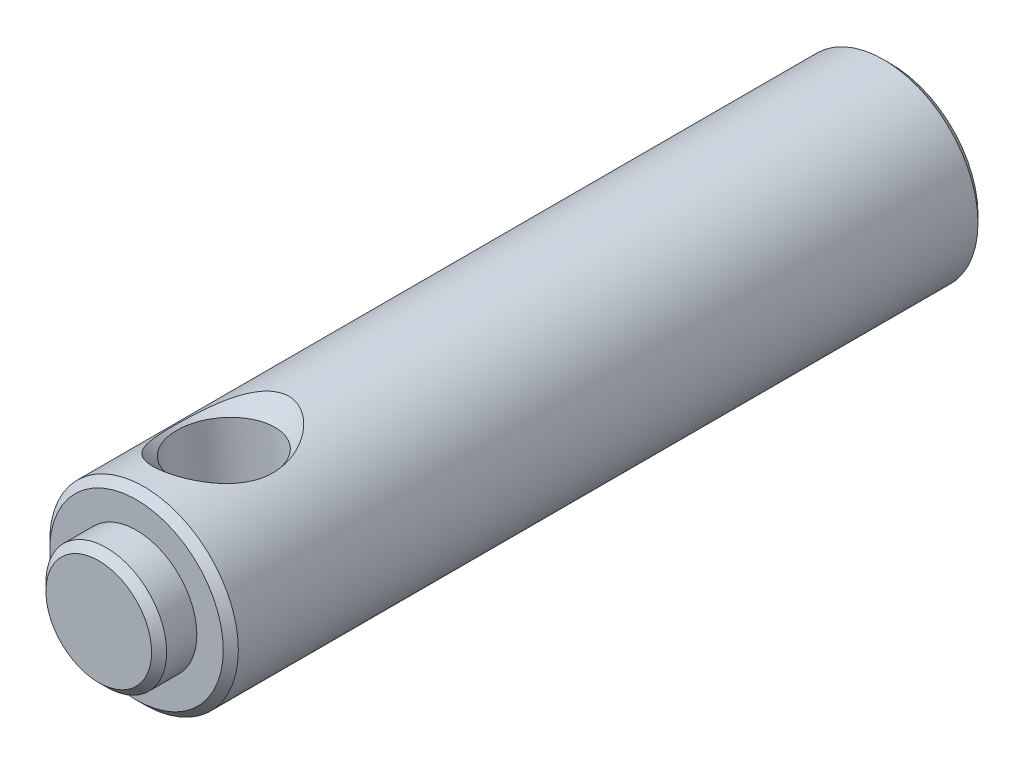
ISO-10303-21;
HEADER;
FILE_DESCRIPTION(('STEP AP214'),'2;1');
FILE_NAME('part.step','',(''),(''),'','','');
FILE_SCHEMA(('AUTOMOTIVE_DESIGN { 1 0 10303 214 1 1 1 1 }'));
ENDSEC;
DATA;
#1=APPLICATION_CONTEXT('core data for automotive mechanical design processes');
#2=APPLICATION_PROTOCOL_DEFINITION('international standard','automotive_design',2000,#1);
#3=PRODUCT_CONTEXT('',#1,'mechanical');
#4=PRODUCT('Part','Part','',(#3));
#5=PRODUCT_RELATED_PRODUCT_CATEGORY('part','',(#4));
#6=PRODUCT_DEFINITION_FORMATION('','',#4);
#7=PRODUCT_DEFINITION_CONTEXT('part definition',#1,'design');
#8=PRODUCT_DEFINITION('design','',#6,#7);
#9=PRODUCT_DEFINITION_SHAPE('','',#8);
#10=(LENGTH_UNIT() NAMED_UNIT(*) SI_UNIT(.MILLI.,.METRE.));
#11=(NAMED_UNIT(*) PLANE_ANGLE_UNIT() SI_UNIT($,.RADIAN.));
#12=(NAMED_UNIT(*) SI_UNIT($,.STERADIAN.) SOLID_ANGLE_UNIT());
#13=UNCERTAINTY_MEASURE_WITH_UNIT(LENGTH_MEASURE(1.E-05),#10,'distance_accuracy_value','');
#14=(GEOMETRIC_REPRESENTATION_CONTEXT(3) GLOBAL_UNCERTAINTY_ASSIGNED_CONTEXT((#13)) GLOBAL_UNIT_ASSIGNED_CONTEXT((#10,
#11,#12)) REPRESENTATION_CONTEXT('',''));
#15=CARTESIAN_POINT('',(0.,0.,0.));
#16=DIRECTION('',(0.,0.,1.));
#17=DIRECTION('',(1.,0.,0.));
#18=AXIS2_PLACEMENT_3D('',#15,#16,#17);
#19=CARTESIAN_POINT('',(0.,0.,20.));
#20=DIRECTION('',(0.,0.,-1.));
#21=DIRECTION('',(-1.,0.,0.));
#22=AXIS2_PLACEMENT_3D('',#19,#20,#21);
#23=CYLINDRICAL_SURFACE('',#22,2.5);
#24=CARTESIAN_POINT('',(0.,0.,19.8));
#25=DIRECTION('',(0.,0.,1.));
#26=DIRECTION('',(1.,0.,0.));
#27=AXIS2_PLACEMENT_3D('',#24,#25,#26);
#28=CIRCLE('',#27,2.5);
#29=CARTESIAN_POINT('',(2.5,0.,19.8));
#30=VERTEX_POINT('',#29);
#31=EDGE_CURVE('E41',#30,#30,#28,.F.);
#32=ORIENTED_EDGE('',*,*,#31,.T.);
#33=EDGE_LOOP('',(#32));
#34=FACE_BOUND('',#33,.T.);
#35=CARTESIAN_POINT('',(0.,0.,0.199999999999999));
#36=DIRECTION('',(0.,0.,1.));
#37=DIRECTION('',(1.,0.,0.));
#38=AXIS2_PLACEMENT_3D('',#35,#36,#37);
#39=CIRCLE('',#38,2.5);
#40=CARTESIAN_POINT('',(2.5,0.,0.199999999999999));
#41=VERTEX_POINT('',#40);
#42=EDGE_CURVE('E45',#41,#41,#39,.T.);
#43=ORIENTED_EDGE('',*,*,#42,.T.);
#44=EDGE_LOOP('',(#43));
#45=FACE_BOUND('',#44,.T.);
#46=CARTESIAN_POINT('',(-0.969141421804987,2.30451022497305,16.1102960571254));
#47=CARTESIAN_POINT('',(-0.913977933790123,2.32770949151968,16.0585810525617));
#48=CARTESIAN_POINT('',(-0.854295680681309,2.35048570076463,16.0114111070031));
#49=CARTESIAN_POINT('',(-0.72618172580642,2.39315123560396,15.9291838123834));
#50=CARTESIAN_POINT('',(-0.657773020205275,2.41304786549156,15.894095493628));
#51=CARTESIAN_POINT('',(-0.535920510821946,2.44242353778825,15.8477460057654));
#52=CARTESIAN_POINT('',(-0.484313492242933,2.4532266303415,15.8324783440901));
#53=CARTESIAN_POINT('',(-0.378792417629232,2.47171481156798,15.8103306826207));
#54=CARTESIAN_POINT('',(-0.324880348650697,2.47940252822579,15.8034436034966));
#55=CARTESIAN_POINT('',(-0.216146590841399,2.49124027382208,15.7985638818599));
#56=CARTESIAN_POINT('',(-0.161323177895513,2.49538256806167,15.8005906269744));
#57=CARTESIAN_POINT('',(-0.0525577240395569,2.50004083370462,15.8134215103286));
#58=CARTESIAN_POINT('',(0.00138400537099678,2.50055554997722,15.8242286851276));
#59=CARTESIAN_POINT('',(0.105768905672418,2.49829625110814,15.8535258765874));
#60=CARTESIAN_POINT('',(0.156262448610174,2.49559294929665,15.871845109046));
#61=CARTESIAN_POINT('',(0.254071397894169,2.48754121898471,15.915112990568));
#62=CARTESIAN_POINT('',(0.30138536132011,2.48219159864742,15.9400646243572));
#63=CARTESIAN_POINT('',(0.413355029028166,2.46650489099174,16.008392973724));
#64=CARTESIAN_POINT('',(0.475908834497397,2.45500541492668,16.054953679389));
#65=CARTESIAN_POINT('',(0.592509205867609,2.42950919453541,16.157195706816));
#66=CARTESIAN_POINT('',(0.646534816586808,2.41550647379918,16.2128988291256));
#67=CARTESIAN_POINT('',(0.760510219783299,2.38245704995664,16.3486052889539));
#68=CARTESIAN_POINT('',(0.817584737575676,2.36313127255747,16.4309552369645));
#69=CARTESIAN_POINT('',(0.917480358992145,2.32617028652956,16.604174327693));
#70=CARTESIAN_POINT('',(0.960294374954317,2.3085359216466,16.6950476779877));
#71=CARTESIAN_POINT('',(1.03190270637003,2.27743737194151,16.8839793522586));
#72=CARTESIAN_POINT('',(1.06054421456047,2.26401918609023,16.9821034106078));
#73=CARTESIAN_POINT('',(1.10264148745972,2.24382149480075,17.1821516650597));
#74=CARTESIAN_POINT('',(1.1161102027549,2.23703632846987,17.2840725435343));
#75=CARTESIAN_POINT('',(1.12766808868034,2.23123619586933,17.4914730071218));
#76=CARTESIAN_POINT('',(1.12538159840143,2.23241101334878,17.5969793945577));
#77=CARTESIAN_POINT('',(1.10460572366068,2.24276010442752,17.8060295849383));
#78=CARTESIAN_POINT('',(1.08610618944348,2.25193938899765,17.9095721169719));
#79=CARTESIAN_POINT('',(1.03383473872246,2.27639927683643,18.110005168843));
#80=CARTESIAN_POINT('',(1.0003303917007,2.29157245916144,18.20697935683));
#81=CARTESIAN_POINT('',(0.918503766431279,2.32557768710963,18.3938271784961));
#82=CARTESIAN_POINT('',(0.870180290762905,2.34441002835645,18.4837002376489));
#83=CARTESIAN_POINT('',(0.767906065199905,2.3796524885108,18.639718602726));
#84=CARTESIAN_POINT('',(0.716168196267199,2.3959550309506,18.7073406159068));
#85=CARTESIAN_POINT('',(0.602271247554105,2.4270852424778,18.8335566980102));
#86=CARTESIAN_POINT('',(0.540129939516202,2.44191535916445,18.8921658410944));
#87=CARTESIAN_POINT('',(0.422663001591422,2.46454272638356,18.9840163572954));
#88=CARTESIAN_POINT('',(0.369588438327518,2.47317007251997,19.01992464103));
#89=CARTESIAN_POINT('',(0.258221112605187,2.48725886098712,19.0833093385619));
#90=CARTESIAN_POINT('',(0.199935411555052,2.49272451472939,19.11079694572));
#91=CARTESIAN_POINT('',(0.0882270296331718,2.49897282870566,19.1522000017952));
#92=CARTESIAN_POINT('',(0.0353613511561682,2.50032886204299,19.1675220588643));
#93=CARTESIAN_POINT('',(-0.0720956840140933,2.49953619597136,19.1897262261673));
#94=CARTESIAN_POINT('',(-0.126685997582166,2.49738957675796,19.1966133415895));
#95=CARTESIAN_POINT('',(-0.236116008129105,2.48943052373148,19.2014367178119));
#96=CARTESIAN_POINT('',(-0.290955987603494,2.48361048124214,19.1993543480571));
#97=CARTESIAN_POINT('',(-0.399093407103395,2.46854378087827,19.1863614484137));
#98=CARTESIAN_POINT('',(-0.452390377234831,2.45929609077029,19.1754482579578));
#99=CARTESIAN_POINT('',(-0.554780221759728,2.43821437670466,19.1459436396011));
#100=CARTESIAN_POINT('',(-0.603943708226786,2.42644851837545,19.1275448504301));
#101=CARTESIAN_POINT('',(-0.698660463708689,2.40089261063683,19.0841257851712));
#102=CARTESIAN_POINT('',(-0.744212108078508,2.38710165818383,19.0591025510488));
#103=CARTESIAN_POINT('',(-0.851522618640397,2.35147237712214,18.9905668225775));
#104=CARTESIAN_POINT('',(-0.910993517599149,2.32886939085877,18.9438629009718));
#105=CARTESIAN_POINT('',(-1.02109645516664,2.28274945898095,18.8413324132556));
#106=CARTESIAN_POINT('',(-1.0717066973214,2.259230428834,18.7854839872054));
#107=CARTESIAN_POINT('',(-1.17778856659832,2.20619223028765,18.6494864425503));
#108=CARTESIAN_POINT('',(-1.23038336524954,2.17692043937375,18.566997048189));
#109=CARTESIAN_POINT('',(-1.32184060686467,2.12263218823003,18.3935085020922));
#110=CARTESIAN_POINT('',(-1.36069626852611,2.09761783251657,18.3025051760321));
#111=CARTESIAN_POINT('',(-1.42534373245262,2.05424697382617,18.1133326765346));
#112=CARTESIAN_POINT('',(-1.45099456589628,2.03596288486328,18.0150984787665));
#113=CARTESIAN_POINT('',(-1.48853181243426,2.0086860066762,17.8148553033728));
#114=CARTESIAN_POINT('',(-1.5004306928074,1.9996848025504,17.7128498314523));
#115=CARTESIAN_POINT('',(-1.5104717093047,1.99211517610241,17.5054082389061));
#116=CARTESIAN_POINT('',(-1.50829187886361,1.99379091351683,17.3999471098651));
#117=CARTESIAN_POINT('',(-1.48944085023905,2.00790853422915,17.1909833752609));
#118=CARTESIAN_POINT('',(-1.47275626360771,2.02036036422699,17.0874826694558));
#119=CARTESIAN_POINT('',(-1.4254466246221,2.05400100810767,16.887070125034));
#120=CARTESIAN_POINT('',(-1.39505282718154,2.07504435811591,16.7900784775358));
#121=CARTESIAN_POINT('',(-1.32036455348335,2.12334919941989,16.6033423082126));
#122=CARTESIAN_POINT('',(-1.27608734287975,2.15060295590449,16.5135889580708));
#123=CARTESIAN_POINT('',(-1.1891060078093,2.19947300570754,16.3702155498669));
#124=CARTESIAN_POINT('',(-1.150150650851,2.22022592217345,16.3140054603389));
#125=CARTESIAN_POINT('',(-1.06507478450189,2.26227073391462,16.2073915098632));
#126=CARTESIAN_POINT('',(-1.0189501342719,2.28356293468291,16.1569910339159));
#127=CARTESIAN_POINT('',(-0.969141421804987,2.30451022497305,16.1102960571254));
#128=B_SPLINE_CURVE_WITH_KNOTS('',3,(#46,#47,#48,#49,#50,#51,#52,#53,#54,#55,#56,#57,#58,#59,
#60,#61,#62,#63,#64,#65,#66,#67,#68,#69,#70,#71,#72,#73,#74,#75,#76,#77,#78,#79,#80,#81,#82,#83,
#84,#85,#86,#87,#88,#89,#90,#91,#92,#93,#94,#95,#96,#97,#98,#99,#100,#101,#102,#103,#104,#105,
#106,#107,#108,#109,#110,#111,#112,#113,#114,#115,#116,#117,#118,#119,#120,#121,#122,#123,#124,
#125,#126,#127),.UNSPECIFIED.,.T.,.F.,(4,2,2,2,2,2,2,2,2,2,2,2,2,2,2,2,2,2,2,2,2,2,2,2,2,2,2,2,
2,2,2,2,2,2,2,2,2,2,2,2,4),(0.,0.237032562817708,0.473452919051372,0.637436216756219,
0.801280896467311,0.965482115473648,1.12974014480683,1.290454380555,1.45124106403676,
1.6864019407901,1.92213194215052,2.22668310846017,2.53138541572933,2.83930507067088,
3.14696170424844,3.46197894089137,3.7771935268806,4.086998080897,4.39682767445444,
4.65598529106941,4.91470463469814,5.10799078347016,5.30101887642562,5.4654781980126,
5.62983988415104,5.79454313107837,5.95929601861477,6.12005317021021,6.2808822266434,
6.51634232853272,6.75237374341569,7.05714560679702,7.36206768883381,7.67018078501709,
7.97801433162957,8.29291227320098,8.60810118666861,8.91816139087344,9.22783751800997,
9.44173708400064,9.65576065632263),.UNSPECIFIED.);
#129=CARTESIAN_POINT('',(-0.969141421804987,2.30451022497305,16.1102960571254));
#130=VERTEX_POINT('',#129);
#131=EDGE_CURVE('E67',#130,#130,#128,.T.);
#132=ORIENTED_EDGE('',*,*,#131,.T.);
#133=EDGE_LOOP('',(#132));
#134=FACE_BOUND('',#133,.T.);
#135=CARTESIAN_POINT('',(-0.800670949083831,-2.36831914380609,16.4105921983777));
#136=CARTESIAN_POINT('',(-0.858496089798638,-2.34877319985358,16.4960908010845));
#137=CARTESIAN_POINT('',(-0.908734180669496,-2.32944714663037,16.5868558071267));
#138=CARTESIAN_POINT('',(-0.993977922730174,-2.29437017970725,16.7760440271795));
#139=CARTESIAN_POINT('',(-1.02895420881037,-2.27862618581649,16.8744815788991));
#140=CARTESIAN_POINT('',(-1.08333906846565,-2.25328480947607,17.0770149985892));
#141=CARTESIAN_POINT('',(-1.10265313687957,-2.24372480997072,17.1811412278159));
#142=CARTESIAN_POINT('',(-1.12483360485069,-2.23269147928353,17.3914460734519));
#143=CARTESIAN_POINT('',(-1.12771988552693,-2.23120837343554,17.4976220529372));
#144=CARTESIAN_POINT('',(-1.11712194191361,-2.23652992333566,17.7066304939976));
#145=CARTESIAN_POINT('',(-1.1039886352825,-2.24315693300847,17.8094857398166));
#146=CARTESIAN_POINT('',(-1.06228803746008,-2.26319917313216,18.0114352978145));
#147=CARTESIAN_POINT('',(-1.03370228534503,-2.27662252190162,18.1105249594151));
#148=CARTESIAN_POINT('',(-0.961086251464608,-2.30822413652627,18.3035867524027));
#149=CARTESIAN_POINT('',(-0.916855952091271,-2.32646316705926,18.3974734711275));
#150=CARTESIAN_POINT('',(-0.813191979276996,-2.36469171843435,18.5760692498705));
#151=CARTESIAN_POINT('',(-0.753773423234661,-2.38467948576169,18.6607873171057));
#152=CARTESIAN_POINT('',(-0.638110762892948,-2.41771892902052,18.7959554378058));
#153=CARTESIAN_POINT('',(-0.585495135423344,-2.43116536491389,18.8494190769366));
#154=CARTESIAN_POINT('',(-0.472264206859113,-2.45566849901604,18.9477341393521));
#155=CARTESIAN_POINT('',(-0.411663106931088,-2.46672934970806,18.9926005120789));
#156=CARTESIAN_POINT('',(-0.296562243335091,-2.48287714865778,19.0629091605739));
#157=CARTESIAN_POINT('',(-0.24346030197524,-2.48873128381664,19.0904520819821));
#158=CARTESIAN_POINT('',(-0.133390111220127,-2.49704686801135,19.1370915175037));
#159=CARTESIAN_POINT('',(-0.0764246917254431,-2.49951077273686,19.1561941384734));
#160=CARTESIAN_POINT('',(0.0404061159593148,-2.50035949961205,19.1846758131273));
#161=CARTESIAN_POINT('',(0.100289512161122,-2.49871466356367,19.1939834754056));
#162=CARTESIAN_POINT('',(0.220468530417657,-2.49098615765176,19.2017767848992));
#163=CARTESIAN_POINT('',(0.280763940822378,-2.48490461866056,19.2002676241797));
#164=CARTESIAN_POINT('',(0.39272082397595,-2.46953404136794,19.187380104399));
#165=CARTESIAN_POINT('',(0.444581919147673,-2.46069063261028,19.177148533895));
#166=CARTESIAN_POINT('',(0.545610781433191,-2.44028053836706,19.1490452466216));
#167=CARTESIAN_POINT('',(0.594777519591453,-2.42871282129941,19.1311706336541));
#168=CARTESIAN_POINT('',(0.703540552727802,-2.39980439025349,19.082518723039));
#169=CARTESIAN_POINT('',(0.761943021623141,-2.38176686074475,19.0494917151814));
#170=CARTESIAN_POINT('',(0.872008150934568,-2.34371762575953,18.9745354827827));
#171=CARTESIAN_POINT('',(0.923657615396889,-2.32370218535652,18.9325892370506));
#172=CARTESIAN_POINT('',(1.03591725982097,-2.27633734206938,18.8267610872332));
#173=CARTESIAN_POINT('',(1.09389109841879,-2.24874011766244,18.7602012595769));
#174=CARTESIAN_POINT('',(1.19810921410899,-2.19498968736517,18.6179997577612));
#175=CARTESIAN_POINT('',(1.24434086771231,-2.1688380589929,18.5423484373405));
#176=CARTESIAN_POINT('',(1.32642756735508,-2.11965242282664,18.3824942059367));
#177=CARTESIAN_POINT('',(1.36204138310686,-2.09669642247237,18.2981437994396));
#178=CARTESIAN_POINT('',(1.42177337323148,-2.05666070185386,18.1241919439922));
#179=CARTESIAN_POINT('',(1.44589546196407,-2.0395789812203,18.0345922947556));
#180=CARTESIAN_POINT('',(1.48509779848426,-2.01125949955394,17.8397017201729));
#181=CARTESIAN_POINT('',(1.49853950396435,-2.00110738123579,17.733913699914));
#182=CARTESIAN_POINT('',(1.51045661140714,-1.99212969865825,17.5210329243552));
#183=CARTESIAN_POINT('',(1.50893453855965,-1.99330222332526,17.4139403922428));
#184=CARTESIAN_POINT('',(1.49126763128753,-2.00654625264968,17.2053336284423));
#185=CARTESIAN_POINT('',(1.4756168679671,-2.01824946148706,17.1037529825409));
#186=CARTESIAN_POINT('',(1.43051013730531,-2.0504635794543,16.9050511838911));
#187=CARTESIAN_POINT('',(1.40103785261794,-2.07098489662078,16.8079354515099));
#188=CARTESIAN_POINT('',(1.32734517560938,-2.11899449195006,16.6183331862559));
#189=CARTESIAN_POINT('',(1.28277179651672,-2.14664532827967,16.5260250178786));
#190=CARTESIAN_POINT('',(1.17858199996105,-2.20556531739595,16.3516070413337));
#191=CARTESIAN_POINT('',(1.11898887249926,-2.23682882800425,16.2694817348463));
#192=CARTESIAN_POINT('',(1.0055588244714,-2.28941296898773,16.1433784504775));
#193=CARTESIAN_POINT('',(0.955947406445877,-2.31072475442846,16.0955875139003));
#194=CARTESIAN_POINT('',(0.849296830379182,-2.35200977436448,16.0084566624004));
#195=CARTESIAN_POINT('',(0.792270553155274,-2.37198524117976,15.9691023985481));
#196=CARTESIAN_POINT('',(0.68268973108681,-2.40552834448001,15.9075883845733));
#197=CARTESIAN_POINT('',(0.631329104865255,-2.41959338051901,15.8835843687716));
#198=CARTESIAN_POINT('',(0.524776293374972,-2.44491279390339,15.8440307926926));
#199=CARTESIAN_POINT('',(0.469586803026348,-2.45616912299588,15.828475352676));
#200=CARTESIAN_POINT('',(0.356406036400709,-2.4751325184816,15.806903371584));
#201=CARTESIAN_POINT('',(0.298400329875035,-2.48281855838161,15.800942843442));
#202=CARTESIAN_POINT('',(0.181849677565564,-2.4940639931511,15.7992654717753));
#203=CARTESIAN_POINT('',(0.123304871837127,-2.49762443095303,15.8035460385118));
#204=CARTESIAN_POINT('',(0.0130604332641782,-2.50051833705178,15.8211027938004));
#205=CARTESIAN_POINT('',(-0.0387725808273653,-2.50021132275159,15.8335130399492));
#206=CARTESIAN_POINT('',(-0.140005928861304,-2.4965914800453,15.8656357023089));
#207=CARTESIAN_POINT('',(-0.189404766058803,-2.49327682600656,15.8853525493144));
#208=CARTESIAN_POINT('',(-0.301429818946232,-2.48260049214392,15.9389727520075));
#209=CARTESIAN_POINT('',(-0.362738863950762,-2.47423703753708,15.9754236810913));
#210=CARTESIAN_POINT('',(-0.478470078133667,-2.45449175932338,16.0572697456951));
#211=CARTESIAN_POINT('',(-0.532884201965,-2.44310645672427,16.1026751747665));
#212=CARTESIAN_POINT('',(-0.624475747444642,-2.42111249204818,16.1907559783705));
#213=CARTESIAN_POINT('',(-0.662933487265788,-2.41079579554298,16.2321943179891));
#214=CARTESIAN_POINT('',(-0.735237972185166,-2.38973715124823,16.318762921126));
#215=CARTESIAN_POINT('',(-0.769086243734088,-2.37899534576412,16.3638919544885));
#216=CARTESIAN_POINT('',(-0.800670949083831,-2.36831914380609,16.4105921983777));
#217=B_SPLINE_CURVE_WITH_KNOTS('',3,(#135,#136,#137,#138,#139,#140,#141,#142,#143,#144,#145,
#146,#147,#148,#149,#150,#151,#152,#153,#154,#155,#156,#157,#158,#159,#160,#161,#162,#163,#164,
#165,#166,#167,#168,#169,#170,#171,#172,#173,#174,#175,#176,#177,#178,#179,#180,#181,#182,#183,
#184,#185,#186,#187,#188,#189,#190,#191,#192,#193,#194,#195,#196,#197,#198,#199,#200,#201,#202,
#203,#204,#205,#206,#207,#208,#209,#210,#211,#212,#213,#214,#215,#216),.UNSPECIFIED.,.T.,.F.,(4,
2,2,2,2,2,2,2,2,2,2,2,2,2,2,2,2,2,2,2,2,2,2,2,2,2,2,2,2,2,2,2,2,2,2,2,2,2,2,2,4),(0.,
0.314942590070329,0.63048851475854,0.947924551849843,1.264976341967,1.57520593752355,
1.8858069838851,2.20053187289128,2.51494471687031,2.74280964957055,2.97027468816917,
3.14989463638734,3.32938440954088,3.51017353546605,3.69087588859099,3.85094125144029,
4.01106732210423,4.21835991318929,4.42605170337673,4.70202283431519,4.97828940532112,
5.26042330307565,5.54246103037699,5.8621789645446,6.18184294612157,6.49074390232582,
6.80001046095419,7.11707171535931,7.43364431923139,7.64925502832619,7.86449606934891,
8.03903085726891,8.21344402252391,8.38887172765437,8.5642550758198,8.72346525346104,
8.88277213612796,9.09704691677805,9.31156946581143,9.48365157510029,9.65567655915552),.UNSPECIFIED.);
#218=CARTESIAN_POINT('',(-0.800670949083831,-2.36831914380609,16.4105921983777));
#219=VERTEX_POINT('',#218);
#220=EDGE_CURVE('E60',#219,#219,#217,.T.);
#221=ORIENTED_EDGE('',*,*,#220,.T.);
#222=EDGE_LOOP('',(#221));
#223=FACE_BOUND('',#222,.T.);
#224=ADVANCED_FACE('F34',(#34,#45,#134,#223),#23,.T.);
#225=CARTESIAN_POINT('',(0.,0.,20.));
#226=DIRECTION('',(0.,0.,1.));
#227=DIRECTION('',(1.,0.,0.));
#228=AXIS2_PLACEMENT_3D('',#225,#226,#227);
#229=PLANE('',#228);
#230=CARTESIAN_POINT('',(0.,0.,20.));
#231=DIRECTION('',(0.,0.,1.));
#232=DIRECTION('',(1.,0.,0.));
#233=AXIS2_PLACEMENT_3D('',#230,#231,#232);
#234=CIRCLE('',#233,2.3);
#235=CARTESIAN_POINT('',(2.3,0.,20.));
#236=VERTEX_POINT('',#235);
#237=EDGE_CURVE('E49',#236,#236,#234,.T.);
#238=ORIENTED_EDGE('',*,*,#237,.T.);
#239=EDGE_LOOP('',(#238));
#240=FACE_BOUND('',#239,.T.);
#241=CARTESIAN_POINT('',(0.,0.,20.));
#242=DIRECTION('',(0.,0.,1.));
#243=DIRECTION('',(1.,0.,0.));
#244=AXIS2_PLACEMENT_3D('',#241,#242,#243);
#245=CIRCLE('',#244,1.6);
#246=CARTESIAN_POINT('',(1.6,0.,20.));
#247=VERTEX_POINT('',#246);
#248=EDGE_CURVE('E110',#247,#247,#245,.T.);
#249=ORIENTED_EDGE('',*,*,#248,.F.);
#250=EDGE_LOOP('',(#249));
#251=FACE_BOUND('',#250,.T.);
#252=ADVANCED_FACE('F92',(#240,#251),#229,.T.);
#253=CARTESIAN_POINT('',(0.,0.,0.));
#254=DIRECTION('',(0.,0.,1.));
#255=DIRECTION('',(1.,0.,0.));
#256=AXIS2_PLACEMENT_3D('',#253,#254,#255);
#257=PLANE('',#256);
#258=CARTESIAN_POINT('',(0.,0.,0.));
#259=DIRECTION('',(0.,0.,1.));
#260=DIRECTION('',(1.,0.,0.));
#261=AXIS2_PLACEMENT_3D('',#258,#259,#260);
#262=CIRCLE('',#261,2.3);
#263=CARTESIAN_POINT('',(2.3,0.,0.));
#264=VERTEX_POINT('',#263);
#265=EDGE_CURVE('E10',#264,#264,#262,.F.);
#266=ORIENTED_EDGE('',*,*,#265,.T.);
#267=EDGE_LOOP('',(#266));
#268=FACE_BOUND('',#267,.T.);
#269=ADVANCED_FACE('F90',(#268),#257,.F.);
#270=CARTESIAN_POINT('',(0.,0.,21.));
#271=DIRECTION('',(0.,0.,-1.));
#272=DIRECTION('',(-1.,0.,0.));
#273=AXIS2_PLACEMENT_3D('',#270,#271,#272);
#274=CYLINDRICAL_SURFACE('',#273,1.6);
#275=CARTESIAN_POINT('',(0.,0.,20.8));
#276=DIRECTION('',(0.,0.,1.));
#277=DIRECTION('',(1.,0.,0.));
#278=AXIS2_PLACEMENT_3D('',#275,#276,#277);
#279=CIRCLE('',#278,1.6);
#280=CARTESIAN_POINT('',(1.6,0.,20.8));
#281=VERTEX_POINT('',#280);
#282=EDGE_CURVE('E54',#281,#281,#279,.F.);
#283=ORIENTED_EDGE('',*,*,#282,.T.);
#284=EDGE_LOOP('',(#283));
#285=FACE_BOUND('',#284,.T.);
#286=ORIENTED_EDGE('',*,*,#248,.T.);
#287=EDGE_LOOP('',(#286));
#288=FACE_BOUND('',#287,.T.);
#289=ADVANCED_FACE('F86',(#285,#288),#274,.T.);
#290=CARTESIAN_POINT('',(0.,0.,21.));
#291=DIRECTION('',(0.,0.,1.));
#292=DIRECTION('',(1.,0.,0.));
#293=AXIS2_PLACEMENT_3D('',#290,#291,#292);
#294=PLANE('',#293);
#295=CARTESIAN_POINT('',(0.,0.,21.));
#296=DIRECTION('',(0.,0.,1.));
#297=DIRECTION('',(1.,0.,0.));
#298=AXIS2_PLACEMENT_3D('',#295,#296,#297);
#299=CIRCLE('',#298,1.4);
#300=CARTESIAN_POINT('',(1.4,0.,21.));
#301=VERTEX_POINT('',#300);
#302=EDGE_CURVE('E57',#301,#301,#299,.T.);
#303=ORIENTED_EDGE('',*,*,#302,.T.);
#304=EDGE_LOOP('',(#303));
#305=FACE_BOUND('',#304,.T.);
#306=ADVANCED_FACE('F81',(#305),#294,.T.);
#307=CARTESIAN_POINT('',(0.185048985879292,-2.04163093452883,17.5));
#308=DIRECTION('',(0.0902677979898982,-0.995917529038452,0.));
#309=DIRECTION('',(0.995917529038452,0.0902677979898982,0.));
#310=AXIS2_PLACEMENT_3D('',#307,#308,#309);
#311=CONICAL_SURFACE('',#310,1.25,0.785398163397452);
#312=CARTESIAN_POINT('',(0.185048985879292,-2.04163093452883,17.5));
#313=DIRECTION('',(-0.0902677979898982,0.995917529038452,0.));
#314=DIRECTION('',(-0.995917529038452,-0.0902677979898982,0.));
#315=AXIS2_PLACEMENT_3D('',#312,#313,#314);
#316=CIRCLE('',#315,1.25);
#317=CARTESIAN_POINT('',(-1.05984792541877,-2.1544656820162,17.5));
#318=VERTEX_POINT('',#317);
#319=EDGE_CURVE('E112',#318,#318,#316,.T.);
#320=ORIENTED_EDGE('',*,*,#319,.T.);
#321=EDGE_LOOP('',(#320));
#322=FACE_BOUND('',#321,.T.);
#323=ORIENTED_EDGE('',*,*,#220,.F.);
#324=EDGE_LOOP('',(#323));
#325=FACE_BOUND('',#324,.T.);
#326=ADVANCED_FACE('F75',(#322,#325),#311,.F.);
#327=CARTESIAN_POINT('',(-0.225669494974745,2.48979382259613,17.5));
#328=DIRECTION('',(-0.0902677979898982,0.995917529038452,0.));
#329=DIRECTION('',(-0.995917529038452,-0.0902677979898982,0.));
#330=AXIS2_PLACEMENT_3D('',#327,#328,#329);
#331=CONICAL_SURFACE('',#330,1.7,0.785398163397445);
#332=CARTESIAN_POINT('',(-0.185048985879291,2.04163093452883,17.5));
#333=DIRECTION('',(-0.0902677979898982,0.995917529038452,0.));
#334=DIRECTION('',(-0.995917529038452,-0.0902677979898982,0.));
#335=AXIS2_PLACEMENT_3D('',#332,#333,#334);
#336=CIRCLE('',#335,1.25);
#337=CARTESIAN_POINT('',(-1.42994589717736,1.92879618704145,17.5));
#338=VERTEX_POINT('',#337);
#339=EDGE_CURVE('E116',#338,#338,#336,.T.);
#340=ORIENTED_EDGE('',*,*,#339,.F.);
#341=EDGE_LOOP('',(#340));
#342=FACE_BOUND('',#341,.T.);
#343=ORIENTED_EDGE('',*,*,#131,.F.);
#344=EDGE_LOOP('',(#343));
#345=FACE_BOUND('',#344,.T.);
#346=ADVANCED_FACE('F80',(#342,#345),#331,.F.);
#347=CARTESIAN_POINT('',(-0.225669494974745,2.48979382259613,17.5));
#348=DIRECTION('',(-0.0902677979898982,0.995917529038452,0.));
#349=DIRECTION('',(-0.995917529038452,-0.0902677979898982,0.));
#350=AXIS2_PLACEMENT_3D('',#347,#348,#349);
#351=CYLINDRICAL_SURFACE('',#350,1.25);
#352=ORIENTED_EDGE('',*,*,#319,.F.);
#353=EDGE_LOOP('',(#352));
#354=FACE_BOUND('',#353,.T.);
#355=ORIENTED_EDGE('',*,*,#339,.T.);
#356=EDGE_LOOP('',(#355));
#357=FACE_BOUND('',#356,.T.);
#358=ADVANCED_FACE('F83',(#354,#357),#351,.F.);
#359=CARTESIAN_POINT('',(0.,0.,21.));
#360=DIRECTION('',(0.,0.,-1.));
#361=DIRECTION('',(-1.,0.,0.));
#362=AXIS2_PLACEMENT_3D('',#359,#360,#361);
#363=CONICAL_SURFACE('',#362,1.4,0.785398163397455);
#364=ORIENTED_EDGE('',*,*,#282,.F.);
#365=EDGE_LOOP('',(#364));
#366=FACE_BOUND('',#365,.T.);
#367=ORIENTED_EDGE('',*,*,#302,.F.);
#368=EDGE_LOOP('',(#367));
#369=FACE_BOUND('',#368,.T.);
#370=ADVANCED_FACE('F127',(#366,#369),#363,.T.);
#371=CARTESIAN_POINT('',(0.,0.,20.));
#372=DIRECTION('',(0.,0.,-1.));
#373=DIRECTION('',(-1.,0.,0.));
#374=AXIS2_PLACEMENT_3D('',#371,#372,#373);
#375=CONICAL_SURFACE('',#374,2.3,0.785398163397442);
#376=ORIENTED_EDGE('',*,*,#31,.F.);
#377=EDGE_LOOP('',(#376));
#378=FACE_BOUND('',#377,.T.);
#379=ORIENTED_EDGE('',*,*,#237,.F.);
#380=EDGE_LOOP('',(#379));
#381=FACE_BOUND('',#380,.T.);
#382=ADVANCED_FACE('F133',(#378,#381),#375,.T.);
#383=CARTESIAN_POINT('',(0.,0.,0.199999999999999));
#384=DIRECTION('',(0.,0.,1.));
#385=DIRECTION('',(1.,0.,0.));
#386=AXIS2_PLACEMENT_3D('',#383,#384,#385);
#387=CONICAL_SURFACE('',#386,2.5,0.78539816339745);
#388=ORIENTED_EDGE('',*,*,#265,.F.);
#389=EDGE_LOOP('',(#388));
#390=FACE_BOUND('',#389,.T.);
#391=ORIENTED_EDGE('',*,*,#42,.F.);
#392=EDGE_LOOP('',(#391));
#393=FACE_BOUND('',#392,.T.);
#394=ADVANCED_FACE('F36',(#390,#393),#387,.T.);
#395=CLOSED_SHELL('',(#224,#252,#269,#289,#306,#326,#346,#358,#370,#382,#394));
#396=MANIFOLD_SOLID_BREP('B2',#395);
#397=ADVANCED_BREP_SHAPE_REPRESENTATION('',(#18,#396),#14);
#398=SHAPE_DEFINITION_REPRESENTATION(#9,#397);
ENDSEC;
END-ISO-10303-21;
